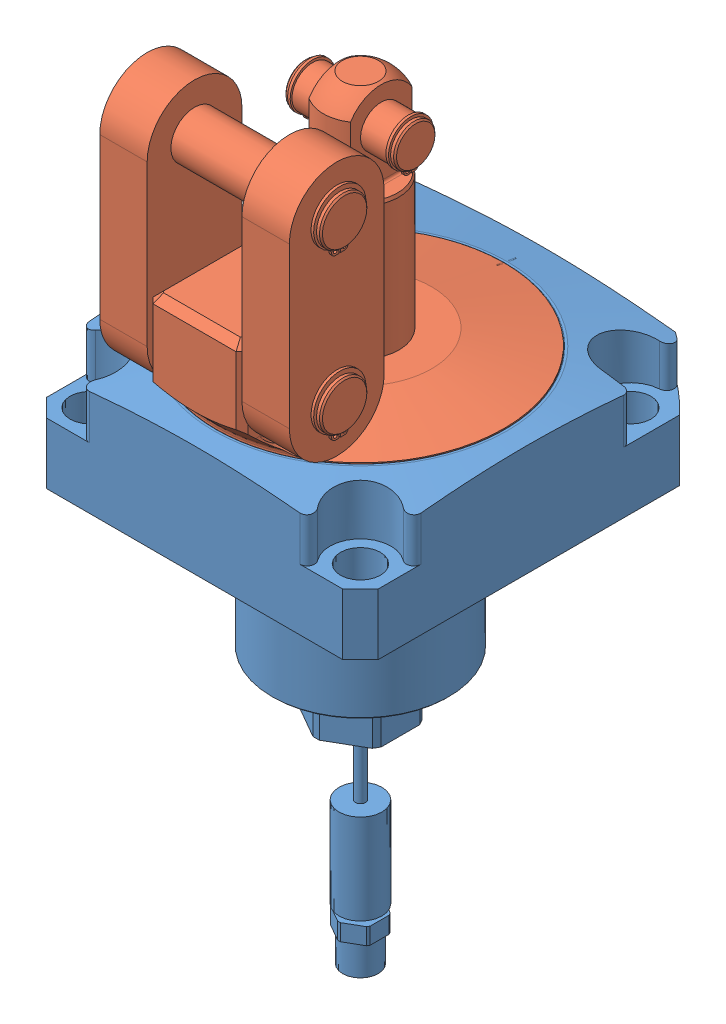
SolidWorks assembly ilc16323200US.SLDASM, configuration Default (file format 13000). Lengths in mm.
Overall size (112 270.35 118).
2 component instances, 2 part files, 3 mates.
Components (placement in the parent):
- ilc16323200US_BODY-1: ilc16323200US_BODY.SLDPRT [Default] at origin size (112 180.47 118)
- ilc16323200US_LUG-1: ilc16323200US_LUG.SLDPRT [Default] at (0 25.5007 0) size (96.93 103 104.47)
Mates (geometry in assembly coordinates):
- Coincident1: coincident anti-aligned: plane of ilc16323200US_BODY-1 through (48.514 25.5007 0) normal (0 1 0); plane of ilc16323200_LUG-1 through (-16 25.5007 0) normal (0 -1 0)
- Concentric1: concentric anti-aligned: cylinder of ilc16323200US_BODY-1 through (0 -8.9689 0) axis (0 -1 0) radius 48.514; cylinder of ilc16323200_LUG-1 through (0 42.132 0) axis (0 1 0) radius 48.465
- LUG ANGLE: planar angle = 3.141593 rad anti-aligned: plane of ilc16323200_LUG-1 through (0 25.5007 0) normal (1 0 0)
